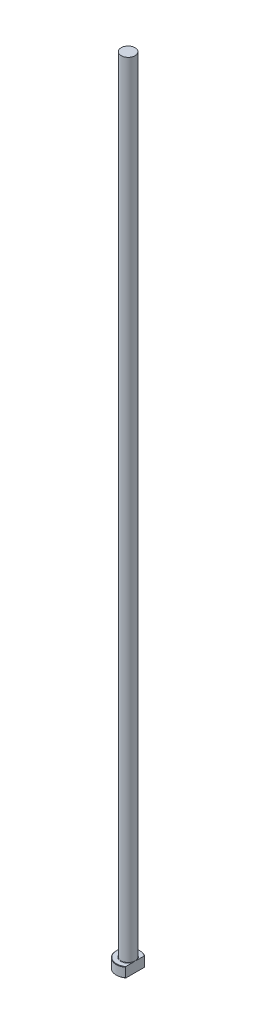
from build123d import *
from build123d.topology import SkipClean

# Parameters (mm, degrees)
CHAMFER1_SIZE = 0.2
FILLET1_R     = 0.2
KEY_DEPTH     = 401.089989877


with BuildPart() as part:
    # Sketch1 → Revolve1 (revolve)
    with BuildSketch(Plane.XY, mode=Mode.PRIVATE) as revolve1_sk:
        Polygon((0, 0), (-6, 0), (-6, 5), (-3.5, 5), (-3.5, 400), (0, 400), align=None)
    revolve(revolve1_sk.sketch.rotate(Axis((0, 259.958771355, 0), (0, -1, 0)), 270), axis=Axis((0, 259.958771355, 0), (0, -1, 0)))

    # Chamfer1
    chamfer1_edges = [part.edges().sort_by_distance(p)[0] for p in [
        (0, 5, -6),
        (0, 0, -6),
    ]]
    chamfer(chamfer1_edges, length=CHAMFER1_SIZE)

    # Fillet1
    fillet1_edges = [part.edges().sort_by_distance(p)[0] for p in [
        (0, 5, -3.5),
    ]]
    fillet(fillet1_edges, radius=FILLET1_R)

    # Sketch2 → KEY (cut, through all)
    with SkipClean():  # the faces are left unmerged after this step: merging them gives an invalid solid
        with BuildSketch(Plane(origin=(0, 0, 0), x_dir=(1, 0, 0), z_dir=(0, 1, 0))):
            with BuildLine():
                Line((3.5, 4.873397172), (3.5, -4.873397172))
                ThreePointArc((3.5, -4.873397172), (6, 0), (3.5, 4.873397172))
            make_face()
        extrude(amount=KEY_DEPTH, mode=Mode.SUBTRACT)


solid = part.part
